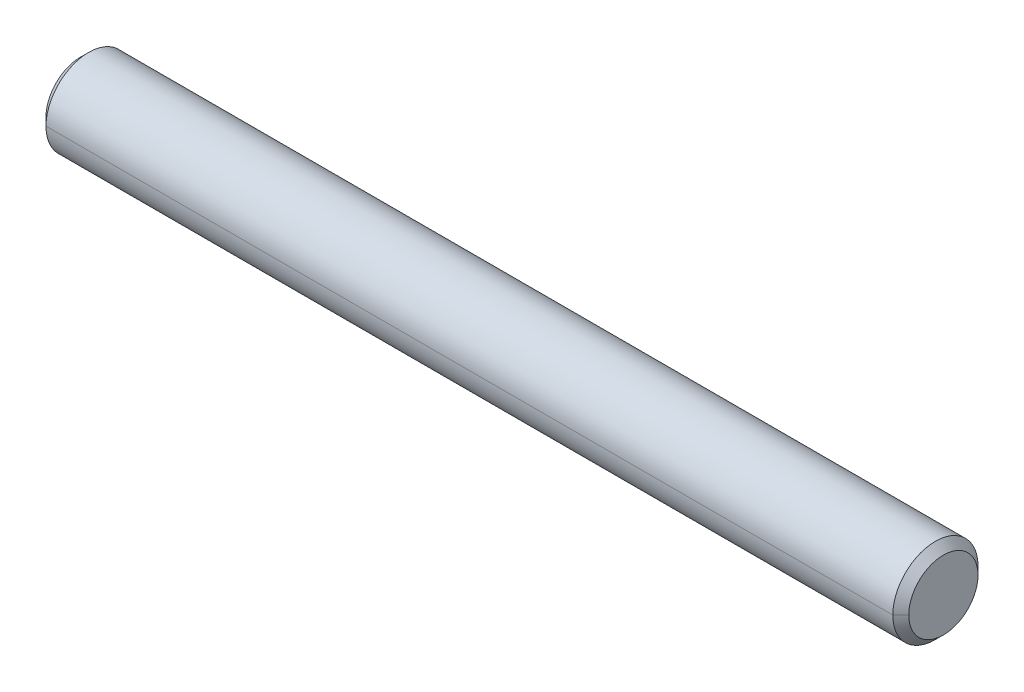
ISO-10303-21;
HEADER;
FILE_DESCRIPTION(('STEP AP214'),'2;1');
FILE_NAME('part.step','',(''),(''),'','','');
FILE_SCHEMA(('AUTOMOTIVE_DESIGN { 1 0 10303 214 1 1 1 1 }'));
ENDSEC;
DATA;
#1=APPLICATION_CONTEXT('core data for automotive mechanical design processes');
#2=APPLICATION_PROTOCOL_DEFINITION('international standard','automotive_design',2000,#1);
#3=PRODUCT_CONTEXT('',#1,'mechanical');
#4=PRODUCT('Part','Part','',(#3));
#5=PRODUCT_RELATED_PRODUCT_CATEGORY('part','',(#4));
#6=PRODUCT_DEFINITION_FORMATION('','',#4);
#7=PRODUCT_DEFINITION_CONTEXT('part definition',#1,'design');
#8=PRODUCT_DEFINITION('design','',#6,#7);
#9=PRODUCT_DEFINITION_SHAPE('','',#8);
#10=(LENGTH_UNIT() NAMED_UNIT(*) SI_UNIT(.MILLI.,.METRE.));
#11=(NAMED_UNIT(*) PLANE_ANGLE_UNIT() SI_UNIT($,.RADIAN.));
#12=(NAMED_UNIT(*) SI_UNIT($,.STERADIAN.) SOLID_ANGLE_UNIT());
#13=UNCERTAINTY_MEASURE_WITH_UNIT(LENGTH_MEASURE(1.E-05),#10,'distance_accuracy_value','');
#14=(GEOMETRIC_REPRESENTATION_CONTEXT(3) GLOBAL_UNCERTAINTY_ASSIGNED_CONTEXT((#13)) GLOBAL_UNIT_ASSIGNED_CONTEXT((#10,
#11,#12)) REPRESENTATION_CONTEXT('',''));
#15=CARTESIAN_POINT('',(0.,0.,0.));
#16=DIRECTION('',(0.,0.,1.));
#17=DIRECTION('',(1.,0.,0.));
#18=AXIS2_PLACEMENT_3D('',#15,#16,#17);
#19=CARTESIAN_POINT('',(-79.5,0.,0.));
#20=DIRECTION('',(1.,0.,0.));
#21=DIRECTION('',(0.,0.,-1.));
#22=AXIS2_PLACEMENT_3D('',#19,#20,#21);
#23=CONICAL_SURFACE('',#22,8.,0.785398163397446);
#24=DIRECTION('',(0.707106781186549,0.,0.707106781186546));
#25=VECTOR('',#24,1.);
#26=CARTESIAN_POINT('',(-79.5,0.,8.));
#27=LINE('',#26,#25);
#28=CARTESIAN_POINT('',(-81.,0.,6.5));
#29=VERTEX_POINT('',#28);
#30=CARTESIAN_POINT('',(-79.5,0.,8.));
#31=VERTEX_POINT('',#30);
#32=EDGE_CURVE('E76',#29,#31,#27,.T.);
#33=ORIENTED_EDGE('',*,*,#32,.F.);
#34=CARTESIAN_POINT('',(-81.,0.,0.));
#35=DIRECTION('',(-1.,0.,0.));
#36=DIRECTION('',(0.,0.,-1.));
#37=AXIS2_PLACEMENT_3D('',#34,#35,#36);
#38=CIRCLE('',#37,6.5);
#39=CARTESIAN_POINT('',(-81.,0.,-6.5));
#40=VERTEX_POINT('',#39);
#41=EDGE_CURVE('E11',#40,#29,#38,.T.);
#42=ORIENTED_EDGE('',*,*,#41,.F.);
#43=DIRECTION('',(0.707106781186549,0.,-0.707106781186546));
#44=VECTOR('',#43,1.);
#45=CARTESIAN_POINT('',(-79.5,0.,-8.));
#46=LINE('',#45,#44);
#47=CARTESIAN_POINT('',(-79.5,0.,-8.));
#48=VERTEX_POINT('',#47);
#49=EDGE_CURVE('E84',#40,#48,#46,.T.);
#50=ORIENTED_EDGE('',*,*,#49,.T.);
#51=CARTESIAN_POINT('',(-79.5,0.,0.));
#52=DIRECTION('',(1.,0.,0.));
#53=DIRECTION('',(0.,0.,-1.));
#54=AXIS2_PLACEMENT_3D('',#51,#52,#53);
#55=CIRCLE('',#54,8.);
#56=EDGE_CURVE('E77',#31,#48,#55,.T.);
#57=ORIENTED_EDGE('',*,*,#56,.F.);
#58=EDGE_LOOP('',(#33,#42,#50,#57));
#59=FACE_BOUND('',#58,.T.);
#60=ADVANCED_FACE('F17',(#59),#23,.T.);
#61=CARTESIAN_POINT('',(81.,0.,0.));
#62=DIRECTION('',(-1.,0.,0.));
#63=DIRECTION('',(0.,0.,1.));
#64=AXIS2_PLACEMENT_3D('',#61,#62,#63);
#65=CONICAL_SURFACE('',#64,6.5,0.785398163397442);
#66=DIRECTION('',(-0.707106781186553,0.,-0.707106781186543));
#67=VECTOR('',#66,1.);
#68=CARTESIAN_POINT('',(81.,0.,-6.5));
#69=LINE('',#68,#67);
#70=CARTESIAN_POINT('',(81.,0.,-6.5));
#71=VERTEX_POINT('',#70);
#72=CARTESIAN_POINT('',(79.5,0.,-8.));
#73=VERTEX_POINT('',#72);
#74=EDGE_CURVE('E95',#71,#73,#69,.T.);
#75=ORIENTED_EDGE('',*,*,#74,.F.);
#76=CARTESIAN_POINT('',(81.,0.,0.));
#77=DIRECTION('',(1.,0.,0.));
#78=DIRECTION('',(0.,0.,-1.));
#79=AXIS2_PLACEMENT_3D('',#76,#77,#78);
#80=CIRCLE('',#79,6.5);
#81=CARTESIAN_POINT('',(81.,0.,6.5));
#82=VERTEX_POINT('',#81);
#83=EDGE_CURVE('E20',#82,#71,#80,.T.);
#84=ORIENTED_EDGE('',*,*,#83,.F.);
#85=DIRECTION('',(-0.707106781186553,0.,0.707106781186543));
#86=VECTOR('',#85,1.);
#87=CARTESIAN_POINT('',(81.,0.,6.5));
#88=LINE('',#87,#86);
#89=CARTESIAN_POINT('',(79.5,0.,8.));
#90=VERTEX_POINT('',#89);
#91=EDGE_CURVE('E106',#82,#90,#88,.T.);
#92=ORIENTED_EDGE('',*,*,#91,.T.);
#93=CARTESIAN_POINT('',(79.5,0.,0.));
#94=DIRECTION('',(-1.,0.,0.));
#95=DIRECTION('',(0.,0.,-1.));
#96=AXIS2_PLACEMENT_3D('',#93,#94,#95);
#97=CIRCLE('',#96,8.);
#98=EDGE_CURVE('E39',#73,#90,#97,.T.);
#99=ORIENTED_EDGE('',*,*,#98,.F.);
#100=EDGE_LOOP('',(#75,#84,#92,#99));
#101=FACE_BOUND('',#100,.T.);
#102=ADVANCED_FACE('F132',(#101),#65,.T.);
#103=CARTESIAN_POINT('',(-81.,0.,0.));
#104=DIRECTION('',(1.,0.,0.));
#105=DIRECTION('',(0.,1.,0.));
#106=AXIS2_PLACEMENT_3D('',#103,#104,#105);
#107=PLANE('',#106);
#108=ORIENTED_EDGE('',*,*,#41,.T.);
#109=CARTESIAN_POINT('',(-81.,0.,0.));
#110=DIRECTION('',(-1.,0.,0.));
#111=DIRECTION('',(0.,0.,-1.));
#112=AXIS2_PLACEMENT_3D('',#109,#110,#111);
#113=CIRCLE('',#112,6.5);
#114=EDGE_CURVE('E71',#29,#40,#113,.T.);
#115=ORIENTED_EDGE('',*,*,#114,.T.);
#116=EDGE_LOOP('',(#108,#115));
#117=FACE_BOUND('',#116,.T.);
#118=ADVANCED_FACE('F69',(#117),#107,.F.);
#119=CARTESIAN_POINT('',(81.,0.,0.));
#120=DIRECTION('',(1.,0.,0.));
#121=DIRECTION('',(0.,1.,0.));
#122=AXIS2_PLACEMENT_3D('',#119,#120,#121);
#123=PLANE('',#122);
#124=ORIENTED_EDGE('',*,*,#83,.T.);
#125=CARTESIAN_POINT('',(81.,0.,0.));
#126=DIRECTION('',(1.,0.,0.));
#127=DIRECTION('',(0.,0.,-1.));
#128=AXIS2_PLACEMENT_3D('',#125,#126,#127);
#129=CIRCLE('',#128,6.5);
#130=EDGE_CURVE('E91',#71,#82,#129,.T.);
#131=ORIENTED_EDGE('',*,*,#130,.T.);
#132=EDGE_LOOP('',(#124,#131));
#133=FACE_BOUND('',#132,.T.);
#134=ADVANCED_FACE('F128',(#133),#123,.T.);
#135=CARTESIAN_POINT('',(81.,0.,0.));
#136=DIRECTION('',(-1.,0.,0.));
#137=DIRECTION('',(0.,0.,1.));
#138=AXIS2_PLACEMENT_3D('',#135,#136,#137);
#139=CYLINDRICAL_SURFACE('',#138,8.);
#140=DIRECTION('',(-1.,0.,0.));
#141=VECTOR('',#140,1.);
#142=CARTESIAN_POINT('',(81.,0.,-8.));
#143=LINE('',#142,#141);
#144=EDGE_CURVE('E101',#73,#48,#143,.T.);
#145=ORIENTED_EDGE('',*,*,#144,.F.);
#146=ORIENTED_EDGE('',*,*,#98,.T.);
#147=DIRECTION('',(-1.,0.,0.));
#148=VECTOR('',#147,1.);
#149=CARTESIAN_POINT('',(81.,0.,8.));
#150=LINE('',#149,#148);
#151=EDGE_CURVE('E105',#90,#31,#150,.T.);
#152=ORIENTED_EDGE('',*,*,#151,.T.);
#153=ORIENTED_EDGE('',*,*,#56,.T.);
#154=EDGE_LOOP('',(#145,#146,#152,#153));
#155=FACE_BOUND('',#154,.T.);
#156=ADVANCED_FACE('F138',(#155),#139,.T.);
#157=CARTESIAN_POINT('',(81.,0.,0.));
#158=DIRECTION('',(-1.,0.,0.));
#159=DIRECTION('',(0.,0.,1.));
#160=AXIS2_PLACEMENT_3D('',#157,#158,#159);
#161=CYLINDRICAL_SURFACE('',#160,8.);
#162=CARTESIAN_POINT('',(79.5,0.,0.));
#163=DIRECTION('',(-1.,0.,0.));
#164=DIRECTION('',(0.,0.,-1.));
#165=AXIS2_PLACEMENT_3D('',#162,#163,#164);
#166=CIRCLE('',#165,8.);
#167=EDGE_CURVE('E107',#90,#73,#166,.T.);
#168=ORIENTED_EDGE('',*,*,#167,.T.);
#169=ORIENTED_EDGE('',*,*,#144,.T.);
#170=CARTESIAN_POINT('',(-79.5,0.,0.));
#171=DIRECTION('',(1.,0.,0.));
#172=DIRECTION('',(0.,0.,-1.));
#173=AXIS2_PLACEMENT_3D('',#170,#171,#172);
#174=CIRCLE('',#173,8.);
#175=EDGE_CURVE('E81',#48,#31,#174,.T.);
#176=ORIENTED_EDGE('',*,*,#175,.T.);
#177=ORIENTED_EDGE('',*,*,#151,.F.);
#178=EDGE_LOOP('',(#168,#169,#176,#177));
#179=FACE_BOUND('',#178,.T.);
#180=ADVANCED_FACE('F137',(#179),#161,.T.);
#181=CARTESIAN_POINT('',(81.,0.,0.));
#182=DIRECTION('',(-1.,0.,0.));
#183=DIRECTION('',(0.,0.,1.));
#184=AXIS2_PLACEMENT_3D('',#181,#182,#183);
#185=CONICAL_SURFACE('',#184,6.5,0.785398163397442);
#186=ORIENTED_EDGE('',*,*,#130,.F.);
#187=ORIENTED_EDGE('',*,*,#74,.T.);
#188=ORIENTED_EDGE('',*,*,#167,.F.);
#189=ORIENTED_EDGE('',*,*,#91,.F.);
#190=EDGE_LOOP('',(#186,#187,#188,#189));
#191=FACE_BOUND('',#190,.T.);
#192=ADVANCED_FACE('F135',(#191),#185,.T.);
#193=CARTESIAN_POINT('',(-79.5,0.,0.));
#194=DIRECTION('',(1.,0.,0.));
#195=DIRECTION('',(0.,0.,-1.));
#196=AXIS2_PLACEMENT_3D('',#193,#194,#195);
#197=CONICAL_SURFACE('',#196,8.,0.785398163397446);
#198=ORIENTED_EDGE('',*,*,#114,.F.);
#199=ORIENTED_EDGE('',*,*,#32,.T.);
#200=ORIENTED_EDGE('',*,*,#175,.F.);
#201=ORIENTED_EDGE('',*,*,#49,.F.);
#202=EDGE_LOOP('',(#198,#199,#200,#201));
#203=FACE_BOUND('',#202,.T.);
#204=ADVANCED_FACE('F83',(#203),#197,.T.);
#205=CLOSED_SHELL('',(#60,#102,#118,#134,#156,#180,#192,#204));
#206=MANIFOLD_SOLID_BREP('B1',#205);
#207=ADVANCED_BREP_SHAPE_REPRESENTATION('',(#18,#206),#14);
#208=SHAPE_DEFINITION_REPRESENTATION(#9,#207);
ENDSEC;
END-ISO-10303-21;
